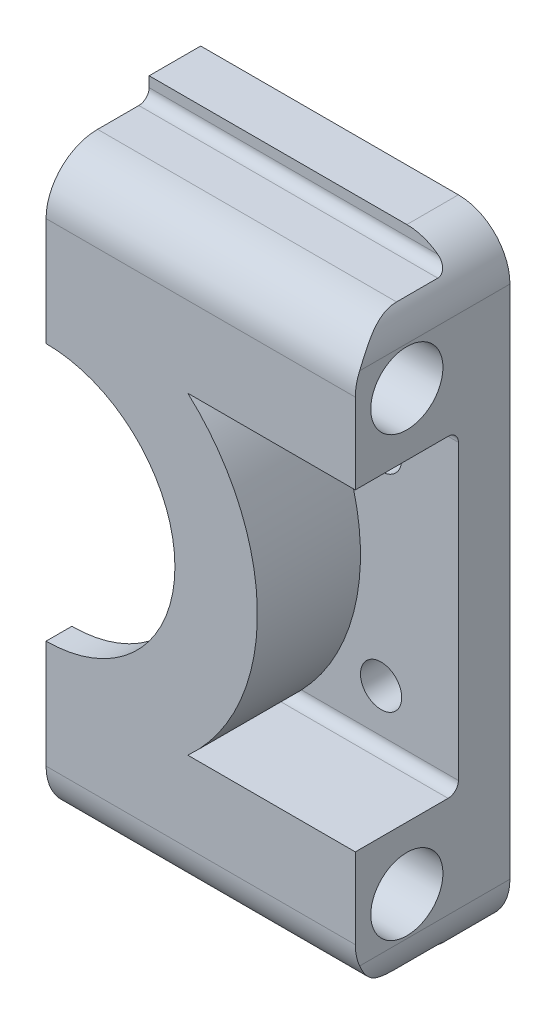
ISO-10303-21;
HEADER;
FILE_DESCRIPTION(('STEP AP214'),'2;1');
FILE_NAME('part.step','',(''),(''),'','','');
FILE_SCHEMA(('AUTOMOTIVE_DESIGN { 1 0 10303 214 1 1 1 1 }'));
ENDSEC;
DATA;
#1=APPLICATION_CONTEXT('core data for automotive mechanical design processes');
#2=APPLICATION_PROTOCOL_DEFINITION('international standard','automotive_design',2000,#1);
#3=PRODUCT_CONTEXT('',#1,'mechanical');
#4=PRODUCT('Part','Part','',(#3));
#5=PRODUCT_RELATED_PRODUCT_CATEGORY('part','',(#4));
#6=PRODUCT_DEFINITION_FORMATION('','',#4);
#7=PRODUCT_DEFINITION_CONTEXT('part definition',#1,'design');
#8=PRODUCT_DEFINITION('design','',#6,#7);
#9=PRODUCT_DEFINITION_SHAPE('','',#8);
#10=(LENGTH_UNIT() NAMED_UNIT(*) SI_UNIT(.MILLI.,.METRE.));
#11=(NAMED_UNIT(*) PLANE_ANGLE_UNIT() SI_UNIT($,.RADIAN.));
#12=(NAMED_UNIT(*) SI_UNIT($,.STERADIAN.) SOLID_ANGLE_UNIT());
#13=UNCERTAINTY_MEASURE_WITH_UNIT(LENGTH_MEASURE(1.E-05),#10,'distance_accuracy_value','');
#14=(GEOMETRIC_REPRESENTATION_CONTEXT(3) GLOBAL_UNCERTAINTY_ASSIGNED_CONTEXT((#13)) GLOBAL_UNIT_ASSIGNED_CONTEXT((#10,
#11,#12)) REPRESENTATION_CONTEXT('',''));
#15=CARTESIAN_POINT('',(0.,0.,0.));
#16=DIRECTION('',(0.,0.,1.));
#17=DIRECTION('',(1.,0.,0.));
#18=AXIS2_PLACEMENT_3D('',#15,#16,#17);
#19=CARTESIAN_POINT('',(9.02091893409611E-13,374.713939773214,-344.));
#20=DIRECTION('',(0.,0.,-1.));
#21=DIRECTION('',(-1.,0.,0.));
#22=AXIS2_PLACEMENT_3D('',#19,#20,#21);
#23=CYLINDRICAL_SURFACE('',#22,36.);
#24=DIRECTION('',(0.,0.,-1.));
#25=VECTOR('',#24,1.);
#26=CARTESIAN_POINT('',(0.,338.713939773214,-344.));
#27=LINE('',#26,#25);
#28=CARTESIAN_POINT('',(0.,338.713939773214,-354.));
#29=VERTEX_POINT('',#28);
#30=CARTESIAN_POINT('',(0.,338.713939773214,-336.598076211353));
#31=VERTEX_POINT('',#30);
#32=EDGE_CURVE('E239',#29,#31,#27,.F.);
#33=ORIENTED_EDGE('',*,*,#32,.T.);
#34=CARTESIAN_POINT('',(0.,338.713939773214,-336.598076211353));
#35=CARTESIAN_POINT('',(0.143758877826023,338.713939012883,-336.598067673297));
#36=CARTESIAN_POINT('',(0.287510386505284,338.714800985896,-336.595922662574));
#37=CARTESIAN_POINT('',(0.574875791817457,338.718243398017,-336.587289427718));
#38=CARTESIAN_POINT('',(0.718489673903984,338.720824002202,-336.58080078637));
#39=CARTESIAN_POINT('',(1.14987870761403,338.731156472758,-336.55465522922));
#40=CARTESIAN_POINT('',(1.43721767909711,338.741498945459,-336.528317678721));
#41=CARTESIAN_POINT('',(2.02442007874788,338.769642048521,-336.454480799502));
#42=CARTESIAN_POINT('',(2.32413949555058,338.787809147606,-336.405933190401));
#43=CARTESIAN_POINT('',(2.76926007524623,338.820300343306,-336.314519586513));
#44=CARTESIAN_POINT('',(2.91679526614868,338.831994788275,-336.280977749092));
#45=CARTESIAN_POINT('',(3.20997254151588,338.857033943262,-336.206997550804));
#46=CARTESIAN_POINT('',(3.3556150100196,338.870378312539,-336.166560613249));
#47=CARTESIAN_POINT('',(3.65314775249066,338.899442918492,-336.075207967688));
#48=CARTESIAN_POINT('',(3.80488076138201,338.91525819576,-336.023805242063));
#49=CARTESIAN_POINT('',(4.10450472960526,338.948373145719,-335.91073078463));
#50=CARTESIAN_POINT('',(4.25239243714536,338.965674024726,-335.849050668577));
#51=CARTESIAN_POINT('',(4.5406444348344,339.001149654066,-335.714233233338));
#52=CARTESIAN_POINT('',(4.6810773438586,339.019311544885,-335.641241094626));
#53=CARTESIAN_POINT('',(4.95314168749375,339.056050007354,-335.480654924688));
#54=CARTESIAN_POINT('',(5.08479116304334,339.074625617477,-335.393092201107));
#55=CARTESIAN_POINT('',(5.30543265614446,339.106892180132,-335.221856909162));
#56=CARTESIAN_POINT('',(5.39727100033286,339.120723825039,-335.141922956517));
#57=CARTESIAN_POINT('',(5.56822830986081,339.147069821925,-334.969185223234));
#58=CARTESIAN_POINT('',(5.64737952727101,339.159587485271,-334.876415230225));
#59=CARTESIAN_POINT('',(5.76093191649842,339.177849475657,-334.712783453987));
#60=CARTESIAN_POINT('',(5.80117346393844,339.18440778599,-334.646100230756));
#61=CARTESIAN_POINT('',(5.87105636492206,339.195888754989,-334.507182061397));
#62=CARTESIAN_POINT('',(5.90070425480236,339.200812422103,-334.434950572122));
#63=CARTESIAN_POINT('',(5.94695522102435,339.208527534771,-334.28530287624));
#64=CARTESIAN_POINT('',(5.96340729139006,339.211294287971,-334.207837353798));
#65=CARTESIAN_POINT('',(5.9806198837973,339.214189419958,-334.051156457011));
#66=CARTESIAN_POINT('',(5.98139903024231,339.214320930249,-333.971943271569));
#67=CARTESIAN_POINT('',(5.96827319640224,339.212112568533,-333.826537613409));
#68=CARTESIAN_POINT('',(5.95649717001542,339.21013099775,-333.760133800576));
#69=CARTESIAN_POINT('',(5.92261470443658,339.204463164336,-333.630100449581));
#70=CARTESIAN_POINT('',(5.90050057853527,339.20077563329,-333.5664730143));
#71=CARTESIAN_POINT('',(5.83740078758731,339.190340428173,-333.419329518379));
#72=CARTESIAN_POINT('',(5.792427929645,339.182961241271,-333.33757991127));
#73=CARTESIAN_POINT('',(5.69028893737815,339.166460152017,-333.182327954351));
#74=CARTESIAN_POINT('',(5.63309544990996,339.157334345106,-333.108844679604));
#75=CARTESIAN_POINT('',(5.46985798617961,339.131765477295,-332.924244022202));
#76=CARTESIAN_POINT('',(5.35632593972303,339.114439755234,-332.819938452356));
#77=CARTESIAN_POINT('',(5.11555609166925,339.079040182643,-332.628935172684));
#78=CARTESIAN_POINT('',(4.988282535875,339.060964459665,-332.542285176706));
#79=CARTESIAN_POINT('',(4.72523061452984,339.025148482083,-332.38319689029));
#80=CARTESIAN_POINT('',(4.58945243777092,339.007408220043,-332.310758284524));
#81=CARTESIAN_POINT('',(4.31215770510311,338.972858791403,-332.177433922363));
#82=CARTESIAN_POINT('',(4.17063558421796,338.956050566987,-332.116559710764));
#83=CARTESIAN_POINT('',(3.88299199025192,338.92366978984,-332.004267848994));
#84=CARTESIAN_POINT('',(3.73685155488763,338.908103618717,-331.952897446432));
#85=CARTESIAN_POINT('',(3.44180625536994,338.878538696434,-331.858611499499));
#86=CARTESIAN_POINT('',(3.29290238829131,338.864539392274,-331.815692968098));
#87=CARTESIAN_POINT('',(2.88474484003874,338.828771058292,-331.708897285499));
#88=CARTESIAN_POINT('',(2.62343850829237,338.808689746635,-331.652260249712));
#89=CARTESIAN_POINT('',(2.09701837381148,338.774097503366,-331.557290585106));
#90=CARTESIAN_POINT('',(1.83190121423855,338.759591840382,-331.518975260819));
#91=CARTESIAN_POINT('',(1.30578831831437,338.736688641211,-331.459381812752));
#92=CARTESIAN_POINT('',(1.04484104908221,338.728156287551,-331.437726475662));
#93=CARTESIAN_POINT('',(0.65303375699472,338.719626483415,-331.416187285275));
#94=CARTESIAN_POINT('',(0.522491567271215,338.71749467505,-331.41083143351));
#95=CARTESIAN_POINT('',(0.261302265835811,338.714651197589,-331.403702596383));
#96=CARTESIAN_POINT('',(0.130655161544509,338.713939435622,-331.401929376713));
#97=CARTESIAN_POINT('',(0.,338.713939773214,-331.401923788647));
#98=B_SPLINE_CURVE_WITH_KNOTS('',3,(#34,#35,#36,#37,#38,#39,#40,#41,#42,#43,#44,#45,#46,#47,#48,
#49,#50,#51,#52,#53,#54,#55,#56,#57,#58,#59,#60,#61,#62,#63,#64,#65,#66,#67,#68,#69,#70,#71,#72,
#73,#74,#75,#76,#77,#78,#79,#80,#81,#82,#83,#84,#85,#86,#87,#88,#89,#90,#91,#92,#93,#94,#95,#96,
#97),.UNSPECIFIED.,.F.,.F.,(4,2,2,2,2,2,2,2,2,2,2,2,2,2,2,2,2,2,2,2,2,2,2,2,2,2,2,2,2,2,2,4),
(0.,0.431242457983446,0.862526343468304,1.72803896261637,2.63945618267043,3.09456857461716,
3.54958713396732,4.03222088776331,4.51525031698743,4.99252776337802,5.46879262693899,
5.83549977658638,6.20125940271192,6.4349997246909,6.66859557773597,6.90482789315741,
7.14077947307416,7.34225470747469,7.54387998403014,7.8230782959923,8.1029082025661,
8.5657207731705,9.02976796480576,9.49380485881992,9.9583025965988,10.4250509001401,
10.891633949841,11.6950842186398,12.4992918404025,13.2847061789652,13.6766666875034,
14.0686015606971),.UNSPECIFIED.);
#99=CARTESIAN_POINT('',(0.,338.713939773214,-331.401923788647));
#100=VERTEX_POINT('',#99);
#101=EDGE_CURVE('E226',#31,#100,#98,.T.);
#102=ORIENTED_EDGE('',*,*,#101,.T.);
#103=CARTESIAN_POINT('',(0.,338.713939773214,-329.));
#104=VERTEX_POINT('',#103);
#105=EDGE_CURVE('E236',#100,#104,#27,.F.);
#106=ORIENTED_EDGE('',*,*,#105,.T.);
#107=CARTESIAN_POINT('',(9.02091893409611E-13,374.713939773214,-329.));
#108=DIRECTION('',(0.,0.,1.));
#109=DIRECTION('',(1.,0.,0.));
#110=AXIS2_PLACEMENT_3D('',#107,#108,#109);
#111=CIRCLE('',#110,36.);
#112=CARTESIAN_POINT('',(0.,410.713939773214,-329.));
#113=VERTEX_POINT('',#112);
#114=EDGE_CURVE('E291',#104,#113,#111,.T.);
#115=ORIENTED_EDGE('',*,*,#114,.T.);
#116=DIRECTION('',(0.,0.,-1.));
#117=VECTOR('',#116,1.);
#118=CARTESIAN_POINT('',(0.,410.713939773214,-344.));
#119=LINE('',#118,#117);
#120=CARTESIAN_POINT('',(0.,410.713939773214,-331.401923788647));
#121=VERTEX_POINT('',#120);
#122=EDGE_CURVE('E272',#113,#121,#119,.T.);
#123=ORIENTED_EDGE('',*,*,#122,.T.);
#124=CARTESIAN_POINT('',(0.,410.713939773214,-336.598076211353));
#125=CARTESIAN_POINT('',(0.143758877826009,410.713940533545,-336.598067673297));
#126=CARTESIAN_POINT('',(0.287510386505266,410.713078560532,-336.595922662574));
#127=CARTESIAN_POINT('',(0.574875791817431,410.709636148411,-336.587289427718));
#128=CARTESIAN_POINT('',(0.718489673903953,410.707055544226,-336.58080078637));
#129=CARTESIAN_POINT('',(1.14987870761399,410.696723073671,-336.55465522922));
#130=CARTESIAN_POINT('',(1.43721767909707,410.686380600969,-336.528317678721));
#131=CARTESIAN_POINT('',(2.02442007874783,410.658237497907,-336.454480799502));
#132=CARTESIAN_POINT('',(2.32413949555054,410.640070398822,-336.405933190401));
#133=CARTESIAN_POINT('',(2.76926007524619,410.607579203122,-336.314519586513));
#134=CARTESIAN_POINT('',(2.91679526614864,410.595884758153,-336.280977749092));
#135=CARTESIAN_POINT('',(3.20997254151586,410.570845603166,-336.206997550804));
#136=CARTESIAN_POINT('',(3.35561501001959,410.557501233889,-336.166560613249));
#137=CARTESIAN_POINT('',(3.65314775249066,410.528436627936,-336.075207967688));
#138=CARTESIAN_POINT('',(3.804880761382,410.512621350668,-336.023805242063));
#139=CARTESIAN_POINT('',(4.10450472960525,410.479506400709,-335.91073078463));
#140=CARTESIAN_POINT('',(4.25239243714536,410.462205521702,-335.849050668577));
#141=CARTESIAN_POINT('',(4.5406444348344,410.426729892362,-335.714233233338));
#142=CARTESIAN_POINT('',(4.6810773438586,410.408568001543,-335.641241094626));
#143=CARTESIAN_POINT('',(4.95314168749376,410.371829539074,-335.480654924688));
#144=CARTESIAN_POINT('',(5.08479116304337,410.353253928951,-335.393092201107));
#145=CARTESIAN_POINT('',(5.3054326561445,410.320987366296,-335.221856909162));
#146=CARTESIAN_POINT('',(5.3972710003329,410.307155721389,-335.141922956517));
#147=CARTESIAN_POINT('',(5.5682283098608,410.280809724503,-334.969185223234));
#148=CARTESIAN_POINT('',(5.64737952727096,410.268292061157,-334.876415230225));
#149=CARTESIAN_POINT('',(5.76093191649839,410.250030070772,-334.712783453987));
#150=CARTESIAN_POINT('',(5.80117346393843,410.243471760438,-334.646100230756));
#151=CARTESIAN_POINT('',(5.87105636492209,410.231990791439,-334.507182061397));
#152=CARTESIAN_POINT('',(5.90070425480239,410.227067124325,-334.434950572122));
#153=CARTESIAN_POINT('',(5.94695522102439,410.219352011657,-334.28530287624));
#154=CARTESIAN_POINT('',(5.96340729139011,410.216585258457,-334.207837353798));
#155=CARTESIAN_POINT('',(5.98061988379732,410.21369012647,-334.05115645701));
#156=CARTESIAN_POINT('',(5.9813990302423,410.213558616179,-333.971943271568));
#157=CARTESIAN_POINT('',(5.9682731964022,410.215766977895,-333.826537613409));
#158=CARTESIAN_POINT('',(5.95649717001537,410.217748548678,-333.760133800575));
#159=CARTESIAN_POINT('',(5.92261470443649,410.223416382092,-333.630100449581));
#160=CARTESIAN_POINT('',(5.90050057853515,410.227103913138,-333.566473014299));
#161=CARTESIAN_POINT('',(5.83740078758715,410.237539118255,-333.419329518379));
#162=CARTESIAN_POINT('',(5.79242792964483,410.244918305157,-333.33757991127));
#163=CARTESIAN_POINT('',(5.69028893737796,410.261419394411,-333.182327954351));
#164=CARTESIAN_POINT('',(5.63309544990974,410.270545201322,-333.108844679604));
#165=CARTESIAN_POINT('',(5.46985798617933,410.296114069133,-332.924244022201));
#166=CARTESIAN_POINT('',(5.3563259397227,410.313439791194,-332.819938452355));
#167=CARTESIAN_POINT('',(5.11555609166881,410.348839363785,-332.628935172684));
#168=CARTESIAN_POINT('',(4.98828253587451,410.366915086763,-332.542285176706));
#169=CARTESIAN_POINT('',(4.72523061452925,410.402731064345,-332.38319689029));
#170=CARTESIAN_POINT('',(4.58945243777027,410.420471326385,-332.310758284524));
#171=CARTESIAN_POINT('',(4.31215770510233,410.455020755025,-332.177433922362));
#172=CARTESIAN_POINT('',(4.17063558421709,410.471828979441,-332.116559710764));
#173=CARTESIAN_POINT('',(3.88299199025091,410.504209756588,-332.004267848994));
#174=CARTESIAN_POINT('',(3.73685155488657,410.519775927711,-331.952897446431));
#175=CARTESIAN_POINT('',(3.44180625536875,410.549340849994,-331.858611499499));
#176=CARTESIAN_POINT('',(3.29290238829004,410.563340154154,-331.815692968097));
#177=CARTESIAN_POINT('',(2.88474484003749,410.599108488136,-331.708897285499));
#178=CARTESIAN_POINT('',(2.62343850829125,410.619189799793,-331.652260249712));
#179=CARTESIAN_POINT('',(2.0970183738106,410.653782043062,-331.557290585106));
#180=CARTESIAN_POINT('',(1.83190121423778,410.668287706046,-331.518975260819));
#181=CARTESIAN_POINT('',(1.30578831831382,410.691190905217,-331.459381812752));
#182=CARTESIAN_POINT('',(1.04484104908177,410.699723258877,-331.437726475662));
#183=CARTESIAN_POINT('',(0.653033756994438,410.708253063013,-331.416187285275));
#184=CARTESIAN_POINT('',(0.522491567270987,410.710384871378,-331.41083143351));
#185=CARTESIAN_POINT('',(0.261302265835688,410.713228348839,-331.403702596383));
#186=CARTESIAN_POINT('',(0.130655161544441,410.713940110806,-331.401929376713));
#187=CARTESIAN_POINT('',(0.,410.713939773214,-331.401923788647));
#188=B_SPLINE_CURVE_WITH_KNOTS('',3,(#124,#125,#126,#127,#128,#129,#130,#131,#132,#133,#134,
#135,#136,#137,#138,#139,#140,#141,#142,#143,#144,#145,#146,#147,#148,#149,#150,#151,#152,#153,
#154,#155,#156,#157,#158,#159,#160,#161,#162,#163,#164,#165,#166,#167,#168,#169,#170,#171,#172,
#173,#174,#175,#176,#177,#178,#179,#180,#181,#182,#183,#184,#185,#186,#187),.UNSPECIFIED.,.F.,
.F.,(4,2,2,2,2,2,2,2,2,2,2,2,2,2,2,2,2,2,2,2,2,2,2,2,2,2,2,2,2,2,2,4),(0.,0.431242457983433,
0.862526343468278,1.72803896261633,2.63945618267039,3.09456857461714,3.54958713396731,
4.03222088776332,4.51525031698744,4.99252776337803,5.46879262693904,5.83549977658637,
6.20125940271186,6.43499972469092,6.66859557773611,6.90482789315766,7.1407794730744,
7.34225470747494,7.54387998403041,7.8230782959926,8.10290820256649,8.56572077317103,
9.02976796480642,9.49380485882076,9.9583025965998,10.4250509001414,10.8916339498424,
11.6950842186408,12.4992918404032,13.2847061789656,13.6766666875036,14.0686015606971),.UNSPECIFIED.);
#189=CARTESIAN_POINT('',(0.,410.713939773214,-336.598076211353));
#190=VERTEX_POINT('',#189);
#191=EDGE_CURVE('E557',#190,#121,#188,.T.);
#192=ORIENTED_EDGE('',*,*,#191,.F.);
#193=CARTESIAN_POINT('',(0.,410.713939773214,-354.));
#194=VERTEX_POINT('',#193);
#195=EDGE_CURVE('E276',#190,#194,#119,.T.);
#196=ORIENTED_EDGE('',*,*,#195,.T.);
#197=CARTESIAN_POINT('',(9.02091893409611E-13,374.713939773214,-354.));
#198=DIRECTION('',(0.,0.,1.));
#199=DIRECTION('',(1.,0.,0.));
#200=AXIS2_PLACEMENT_3D('',#197,#198,#199);
#201=CIRCLE('',#200,36.);
#202=EDGE_CURVE('E307',#29,#194,#201,.T.);
#203=ORIENTED_EDGE('',*,*,#202,.F.);
#204=EDGE_LOOP('',(#33,#102,#106,#115,#123,#192,#196,#203));
#205=FACE_BOUND('',#204,.T.);
#206=ADVANCED_FACE('F45',(#205),#23,.F.);
#207=CARTESIAN_POINT('',(50.0000000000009,424.713939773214,-344.));
#208=DIRECTION('',(0.,0.,-1.));
#209=DIRECTION('',(-1.,0.,0.));
#210=AXIS2_PLACEMENT_3D('',#207,#208,#209);
#211=PLANE('',#210);
#212=CARTESIAN_POINT('',(50.0000000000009,324.713939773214,-344.));
#213=DIRECTION('',(0.,0.,1.));
#214=DIRECTION('',(1.,0.,0.));
#215=AXIS2_PLACEMENT_3D('',#212,#213,#214);
#216=CIRCLE('',#215,10.);
#217=CARTESIAN_POINT('',(50.0000000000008,314.713939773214,-344.));
#218=VERTEX_POINT('',#217);
#219=CARTESIAN_POINT('',(56.0000000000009,316.713939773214,-344.));
#220=VERTEX_POINT('',#219);
#221=EDGE_CURVE('E326',#218,#220,#216,.T.);
#222=ORIENTED_EDGE('',*,*,#221,.T.);
#223=DIRECTION('',(-1.,0.,0.));
#224=VECTOR('',#223,1.);
#225=CARTESIAN_POINT('',(50.0000000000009,316.713939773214,-344.));
#226=LINE('',#225,#224);
#227=CARTESIAN_POINT('',(0.,316.713939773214,-344.));
#228=VERTEX_POINT('',#227);
#229=EDGE_CURVE('E423',#220,#228,#226,.T.);
#230=ORIENTED_EDGE('',*,*,#229,.T.);
#231=DIRECTION('',(0.,1.,0.));
#232=VECTOR('',#231,1.);
#233=CARTESIAN_POINT('',(0.,424.713939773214,-344.));
#234=LINE('',#233,#232);
#235=CARTESIAN_POINT('',(0.,314.713939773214,-344.));
#236=VERTEX_POINT('',#235);
#237=EDGE_CURVE('E262',#236,#228,#234,.T.);
#238=ORIENTED_EDGE('',*,*,#237,.F.);
#239=DIRECTION('',(1.,0.,0.));
#240=VECTOR('',#239,1.);
#241=CARTESIAN_POINT('',(50.0000000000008,314.713939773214,-344.));
#242=LINE('',#241,#240);
#243=EDGE_CURVE('E323',#236,#218,#242,.T.);
#244=ORIENTED_EDGE('',*,*,#243,.T.);
#245=EDGE_LOOP('',(#222,#230,#238,#244));
#246=FACE_BOUND('',#245,.T.);
#247=ADVANCED_FACE('F598',(#246),#211,.F.);
#248=CARTESIAN_POINT('',(45.,354.713939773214,-344.));
#249=DIRECTION('',(0.,0.,1.));
#250=DIRECTION('',(1.,0.,0.));
#251=AXIS2_PLACEMENT_3D('',#248,#249,#250);
#252=CIRCLE('',#251,4.00000000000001);
#253=CARTESIAN_POINT('',(49.,354.713939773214,-344.));
#254=VERTEX_POINT('',#253);
#255=EDGE_CURVE('E295',#254,#254,#252,.T.);
#256=ORIENTED_EDGE('',*,*,#255,.F.);
#257=EDGE_LOOP('',(#256));
#258=FACE_BOUND('',#257,.T.);
#259=CARTESIAN_POINT('',(45.,394.713939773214,-344.));
#260=DIRECTION('',(0.,0.,1.));
#261=DIRECTION('',(1.,0.,0.));
#262=AXIS2_PLACEMENT_3D('',#259,#260,#261);
#263=CIRCLE('',#262,4.00000000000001);
#264=CARTESIAN_POINT('',(49.,394.713939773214,-344.));
#265=VERTEX_POINT('',#264);
#266=EDGE_CURVE('E303',#265,#265,#263,.T.);
#267=ORIENTED_EDGE('',*,*,#266,.F.);
#268=EDGE_LOOP('',(#267));
#269=FACE_BOUND('',#268,.T.);
#270=CARTESIAN_POINT('',(9.02091893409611E-13,374.713939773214,-344.));
#271=DIRECTION('',(0.,0.,-1.));
#272=DIRECTION('',(-1.,0.,0.));
#273=AXIS2_PLACEMENT_3D('',#270,#271,#272);
#274=CIRCLE('',#273,41.);
#275=CARTESIAN_POINT('',(29.5616104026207,346.304237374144,-344.));
#276=VERTEX_POINT('',#275);
#277=CARTESIAN_POINT('',(29.5616104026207,403.123642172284,-344.));
#278=VERTEX_POINT('',#277);
#279=EDGE_CURVE('E364',#276,#278,#274,.F.);
#280=ORIENTED_EDGE('',*,*,#279,.F.);
#281=DIRECTION('',(1.,0.,0.));
#282=VECTOR('',#281,1.);
#283=CARTESIAN_POINT('',(50.0000000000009,346.304237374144,-344.));
#284=LINE('',#283,#282);
#285=CARTESIAN_POINT('',(60.0000000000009,346.304237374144,-344.));
#286=VERTEX_POINT('',#285);
#287=EDGE_CURVE('E231',#276,#286,#284,.T.);
#288=ORIENTED_EDGE('',*,*,#287,.T.);
#289=DIRECTION('',(0.,1.,0.));
#290=VECTOR('',#289,1.);
#291=CARTESIAN_POINT('',(60.0000000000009,424.713939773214,-344.));
#292=LINE('',#291,#290);
#293=CARTESIAN_POINT('',(60.0000000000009,403.123642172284,-344.));
#294=VERTEX_POINT('',#293);
#295=EDGE_CURVE('E330',#286,#294,#292,.T.);
#296=ORIENTED_EDGE('',*,*,#295,.T.);
#297=DIRECTION('',(1.,0.,0.));
#298=VECTOR('',#297,1.);
#299=CARTESIAN_POINT('',(27.5000000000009,403.123642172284,-344.));
#300=LINE('',#299,#298);
#301=EDGE_CURVE('E382',#294,#278,#300,.F.);
#302=ORIENTED_EDGE('',*,*,#301,.T.);
#303=EDGE_LOOP('',(#280,#288,#296,#302));
#304=FACE_BOUND('',#303,.T.);
#305=ADVANCED_FACE('F604',(#258,#269,#304),#211,.F.);
#306=CARTESIAN_POINT('',(0.,432.713939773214,-344.));
#307=VERTEX_POINT('',#306);
#308=CARTESIAN_POINT('',(0.,434.713939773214,-344.));
#309=VERTEX_POINT('',#308);
#310=EDGE_CURVE('E268',#307,#309,#234,.T.);
#311=ORIENTED_EDGE('',*,*,#310,.F.);
#312=DIRECTION('',(-1.,0.,0.));
#313=VECTOR('',#312,1.);
#314=CARTESIAN_POINT('',(58.0000000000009,432.713939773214,-344.));
#315=LINE('',#314,#313);
#316=CARTESIAN_POINT('',(56.0000000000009,432.713939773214,-344.));
#317=VERTEX_POINT('',#316);
#318=EDGE_CURVE('E515',#307,#317,#315,.F.);
#319=ORIENTED_EDGE('',*,*,#318,.T.);
#320=CARTESIAN_POINT('',(50.0000000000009,424.713939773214,-344.));
#321=DIRECTION('',(0.,0.,1.));
#322=DIRECTION('',(-1.,0.,0.));
#323=AXIS2_PLACEMENT_3D('',#320,#321,#322);
#324=CIRCLE('',#323,10.);
#325=CARTESIAN_POINT('',(50.0000000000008,434.713939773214,-344.));
#326=VERTEX_POINT('',#325);
#327=EDGE_CURVE('E315',#317,#326,#324,.T.);
#328=ORIENTED_EDGE('',*,*,#327,.T.);
#329=DIRECTION('',(-1.,0.,0.));
#330=VECTOR('',#329,1.);
#331=CARTESIAN_POINT('',(50.0000000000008,434.713939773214,-344.));
#332=LINE('',#331,#330);
#333=EDGE_CURVE('E318',#326,#309,#332,.T.);
#334=ORIENTED_EDGE('',*,*,#333,.T.);
#335=EDGE_LOOP('',(#311,#319,#328,#334));
#336=FACE_BOUND('',#335,.T.);
#337=ADVANCED_FACE('F406',(#336),#211,.F.);
#338=CARTESIAN_POINT('',(9.02091893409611E-13,374.713939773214,-329.));
#339=DIRECTION('',(0.,0.,-1.));
#340=DIRECTION('',(-1.,0.,0.));
#341=AXIS2_PLACEMENT_3D('',#338,#339,#340);
#342=CYLINDRICAL_SURFACE('',#341,41.);
#343=DIRECTION('',(0.,0.,-1.));
#344=VECTOR('',#343,1.);
#345=CARTESIAN_POINT('',(27.5000000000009,344.304237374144,-324.));
#346=LINE('',#345,#344);
#347=CARTESIAN_POINT('',(27.5000000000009,344.304237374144,-324.));
#348=VERTEX_POINT('',#347);
#349=CARTESIAN_POINT('',(27.5000000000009,344.304237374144,-342.));
#350=VERTEX_POINT('',#349);
#351=EDGE_CURVE('E653',#348,#350,#346,.T.);
#352=ORIENTED_EDGE('',*,*,#351,.T.);
#353=CARTESIAN_POINT('',(27.5000000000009,344.304237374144,-342.));
#354=CARTESIAN_POINT('',(27.4999857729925,344.304225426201,-342.043837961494));
#355=CARTESIAN_POINT('',(27.5015933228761,344.305678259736,-342.087665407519));
#356=CARTESIAN_POINT('',(27.5079421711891,344.311420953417,-342.174863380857));
#357=CARTESIAN_POINT('',(27.5126803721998,344.315708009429,-342.21823431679));
#358=CARTESIAN_POINT('',(27.5251193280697,344.326971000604,-342.30374679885));
#359=CARTESIAN_POINT('',(27.5327903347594,344.333919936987,-342.345896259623));
#360=CARTESIAN_POINT('',(27.5509058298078,344.350347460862,-342.429085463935));
#361=CARTESIAN_POINT('',(27.5613508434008,344.359826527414,-342.470124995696));
#362=CARTESIAN_POINT('',(27.5964318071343,344.391704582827,-342.590856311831));
#363=CARTESIAN_POINT('',(27.6248755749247,344.417600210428,-342.668564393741));
#364=CARTESIAN_POINT('',(27.6900068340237,344.477116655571,-342.817370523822));
#365=CARTESIAN_POINT('',(27.7267164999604,344.510758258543,-342.8884500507));
#366=CARTESIAN_POINT('',(27.8254560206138,344.601644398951,-343.055464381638));
#367=CARTESIAN_POINT('',(27.8912392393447,344.662517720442,-343.147207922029));
#368=CARTESIAN_POINT('',(28.0320856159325,344.793854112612,-343.315361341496));
#369=CARTESIAN_POINT('',(28.1071677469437,344.864336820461,-343.391739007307));
#370=CARTESIAN_POINT('',(28.2960903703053,345.043173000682,-343.558952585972));
#371=CARTESIAN_POINT('',(28.413025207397,345.155051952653,-343.642511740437));
#372=CARTESIAN_POINT('',(28.6534592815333,345.388055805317,-343.783018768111));
#373=CARTESIAN_POINT('',(28.7769691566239,345.509195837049,-343.839921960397));
#374=CARTESIAN_POINT('',(29.0112322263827,345.742019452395,-343.92280656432));
#375=CARTESIAN_POINT('',(29.1216494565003,345.852991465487,-343.951764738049));
#376=CARTESIAN_POINT('',(29.2871526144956,346.021277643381,-343.980693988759));
#377=CARTESIAN_POINT('',(29.3421474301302,346.077519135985,-343.987918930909));
#378=CARTESIAN_POINT('',(29.4520151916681,346.1905279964,-343.997568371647));
#379=CARTESIAN_POINT('',(29.5068881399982,346.247295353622,-343.999992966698));
#380=CARTESIAN_POINT('',(29.5616104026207,346.304237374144,-344.));
#381=B_SPLINE_CURVE_WITH_KNOTS('',3,(#353,#354,#355,#356,#357,#358,#359,#360,#361,#362,#363,
#364,#365,#366,#367,#368,#369,#370,#371,#372,#373,#374,#375,#376,#377,#378,#379,#380),
.UNSPECIFIED.,.F.,.F.,(4,2,2,2,2,2,2,2,2,2,2,2,2,4),(0.,0.13144334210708,0.262756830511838,
0.39277227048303,0.522812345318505,0.781673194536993,1.04123693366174,1.42385098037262,
1.8072589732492,2.35073958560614,2.89512795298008,3.37144651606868,3.60829477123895,
3.84513826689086),.UNSPECIFIED.);
#382=EDGE_CURVE('E414',#350,#276,#381,.T.);
#383=ORIENTED_EDGE('',*,*,#382,.T.);
#384=ORIENTED_EDGE('',*,*,#279,.T.);
#385=CARTESIAN_POINT('',(29.5616104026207,403.123642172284,-344.));
#386=CARTESIAN_POINT('',(29.4871420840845,403.20113569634,-343.999978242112));
#387=CARTESIAN_POINT('',(29.4123666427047,403.278327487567,-343.995495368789));
#388=CARTESIAN_POINT('',(29.2626690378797,403.431662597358,-343.977652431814));
#389=CARTESIAN_POINT('',(29.1877468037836,403.507804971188,-343.964284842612));
#390=CARTESIAN_POINT('',(29.0376787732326,403.659141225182,-343.928557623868));
#391=CARTESIAN_POINT('',(28.9625370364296,403.734320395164,-343.906118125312));
#392=CARTESIAN_POINT('',(28.8133794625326,403.882419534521,-343.852151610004));
#393=CARTESIAN_POINT('',(28.7393631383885,403.955340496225,-343.820628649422));
#394=CARTESIAN_POINT('',(28.5572737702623,404.133410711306,-343.730505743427));
#395=CARTESIAN_POINT('',(28.4502741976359,404.23685375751,-343.66620574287));
#396=CARTESIAN_POINT('',(28.2438015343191,404.434437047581,-343.515647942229));
#397=CARTESIAN_POINT('',(28.1443048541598,404.528606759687,-343.429463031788));
#398=CARTESIAN_POINT('',(27.9861127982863,404.677008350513,-343.263097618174));
#399=CARTESIAN_POINT('',(27.9242078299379,404.734679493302,-343.189054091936));
#400=CARTESIAN_POINT('',(27.809044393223,404.841388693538,-343.028872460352));
#401=CARTESIAN_POINT('',(27.7557763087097,404.890436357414,-342.942748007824));
#402=CARTESIAN_POINT('',(27.6717996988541,404.967435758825,-342.778923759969));
#403=CARTESIAN_POINT('',(27.6387058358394,404.997654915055,-342.703524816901));
#404=CARTESIAN_POINT('',(27.5820215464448,405.049291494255,-342.546502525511));
#405=CARTESIAN_POINT('',(27.5584067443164,405.070731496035,-342.464895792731));
#406=CARTESIAN_POINT('',(27.5272499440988,405.098982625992,-342.319354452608));
#407=CARTESIAN_POINT('',(27.5171117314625,405.108160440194,-342.256433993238));
#408=CARTESIAN_POINT('',(27.506887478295,405.117412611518,-342.160967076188));
#409=CARTESIAN_POINT('',(27.5043097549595,405.119744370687,-342.128884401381));
#410=CARTESIAN_POINT('',(27.5008641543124,405.12286072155,-342.064537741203));
#411=CARTESIAN_POINT('',(27.4999970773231,405.123644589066,-342.032273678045));
#412=CARTESIAN_POINT('',(27.5000000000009,405.123642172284,-342.));
#413=B_SPLINE_CURVE_WITH_KNOTS('',3,(#385,#386,#387,#388,#389,#390,#391,#392,#393,#394,#395,
#396,#397,#398,#399,#400,#401,#402,#403,#404,#405,#406,#407,#408,#409,#410,#411,#412),
.UNSPECIFIED.,.F.,.F.,(4,2,2,2,2,2,2,2,2,2,2,2,2,4),(0.,0.322323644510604,0.644920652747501,
0.97042189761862,1.2957780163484,1.78047356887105,2.26357550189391,2.59984098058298,
2.93572945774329,3.19788393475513,3.45935988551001,3.65188933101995,3.74862557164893,
3.84540705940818),.UNSPECIFIED.);
#414=CARTESIAN_POINT('',(27.5000000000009,405.123642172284,-342.));
#415=VERTEX_POINT('',#414);
#416=EDGE_CURVE('E386',#278,#415,#413,.T.);
#417=ORIENTED_EDGE('',*,*,#416,.T.);
#418=DIRECTION('',(0.,0.,-1.));
#419=VECTOR('',#418,1.);
#420=CARTESIAN_POINT('',(27.5000000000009,405.123642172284,-324.));
#421=LINE('',#420,#419);
#422=CARTESIAN_POINT('',(27.5000000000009,405.123642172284,-324.));
#423=VERTEX_POINT('',#422);
#424=EDGE_CURVE('E531',#423,#415,#421,.T.);
#425=ORIENTED_EDGE('',*,*,#424,.F.);
#426=CARTESIAN_POINT('',(9.02091893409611E-13,374.713939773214,-324.));
#427=DIRECTION('',(0.,0.,1.));
#428=DIRECTION('',(1.,0.,0.));
#429=AXIS2_PLACEMENT_3D('',#426,#427,#428);
#430=CIRCLE('',#429,41.);
#431=EDGE_CURVE('E285',#348,#423,#430,.T.);
#432=ORIENTED_EDGE('',*,*,#431,.F.);
#433=EDGE_LOOP('',(#352,#383,#384,#417,#425,#432));
#434=FACE_BOUND('',#433,.T.);
#435=ADVANCED_FACE('F400',(#434),#342,.T.);
#436=CARTESIAN_POINT('',(50.0000000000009,424.713939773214,-354.));
#437=DIRECTION('',(0.,0.,-1.));
#438=DIRECTION('',(-1.,0.,0.));
#439=AXIS2_PLACEMENT_3D('',#436,#437,#438);
#440=PLANE('',#439);
#441=CARTESIAN_POINT('',(45.,394.713939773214,-354.));
#442=DIRECTION('',(0.,0.,1.));
#443=DIRECTION('',(1.,0.,0.));
#444=AXIS2_PLACEMENT_3D('',#441,#442,#443);
#445=CIRCLE('',#444,4.00000000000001);
#446=CARTESIAN_POINT('',(49.,394.713939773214,-354.));
#447=VERTEX_POINT('',#446);
#448=EDGE_CURVE('E299',#447,#447,#445,.T.);
#449=ORIENTED_EDGE('',*,*,#448,.T.);
#450=EDGE_LOOP('',(#449));
#451=FACE_BOUND('',#450,.T.);
#452=CARTESIAN_POINT('',(45.,354.713939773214,-354.));
#453=DIRECTION('',(0.,0.,1.));
#454=DIRECTION('',(1.,0.,0.));
#455=AXIS2_PLACEMENT_3D('',#452,#453,#454);
#456=CIRCLE('',#455,4.00000000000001);
#457=CARTESIAN_POINT('',(49.,354.713939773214,-354.));
#458=VERTEX_POINT('',#457);
#459=EDGE_CURVE('E294',#458,#458,#456,.T.);
#460=ORIENTED_EDGE('',*,*,#459,.T.);
#461=EDGE_LOOP('',(#460));
#462=FACE_BOUND('',#461,.T.);
#463=DIRECTION('',(1.,0.,0.));
#464=VECTOR('',#463,1.);
#465=CARTESIAN_POINT('',(50.0000000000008,314.713939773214,-354.));
#466=LINE('',#465,#464);
#467=CARTESIAN_POINT('',(0.,314.713939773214,-354.));
#468=VERTEX_POINT('',#467);
#469=CARTESIAN_POINT('',(50.0000000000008,314.713939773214,-354.));
#470=VERTEX_POINT('',#469);
#471=EDGE_CURVE('E341',#468,#470,#466,.T.);
#472=ORIENTED_EDGE('',*,*,#471,.F.);
#473=DIRECTION('',(0.,1.,0.));
#474=VECTOR('',#473,1.);
#475=CARTESIAN_POINT('',(0.,424.713939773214,-354.));
#476=LINE('',#475,#474);
#477=EDGE_CURVE('E253',#468,#29,#476,.T.);
#478=ORIENTED_EDGE('',*,*,#477,.T.);
#479=ORIENTED_EDGE('',*,*,#202,.T.);
#480=CARTESIAN_POINT('',(0.,434.713939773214,-354.));
#481=VERTEX_POINT('',#480);
#482=EDGE_CURVE('E263',#194,#481,#476,.T.);
#483=ORIENTED_EDGE('',*,*,#482,.T.);
#484=DIRECTION('',(-1.,0.,0.));
#485=VECTOR('',#484,1.);
#486=CARTESIAN_POINT('',(50.0000000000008,434.713939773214,-354.));
#487=LINE('',#486,#485);
#488=CARTESIAN_POINT('',(50.0000000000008,434.713939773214,-354.));
#489=VERTEX_POINT('',#488);
#490=EDGE_CURVE('E337',#489,#481,#487,.T.);
#491=ORIENTED_EDGE('',*,*,#490,.F.);
#492=CARTESIAN_POINT('',(50.0000000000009,424.713939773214,-354.));
#493=DIRECTION('',(0.,0.,1.));
#494=DIRECTION('',(-1.,0.,0.));
#495=AXIS2_PLACEMENT_3D('',#492,#493,#494);
#496=CIRCLE('',#495,10.);
#497=CARTESIAN_POINT('',(60.0000000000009,424.713939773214,-354.));
#498=VERTEX_POINT('',#497);
#499=EDGE_CURVE('E314',#498,#489,#496,.T.);
#500=ORIENTED_EDGE('',*,*,#499,.F.);
#501=DIRECTION('',(0.,1.,0.));
#502=VECTOR('',#501,1.);
#503=CARTESIAN_POINT('',(60.0000000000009,424.713939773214,-354.));
#504=LINE('',#503,#502);
#505=CARTESIAN_POINT('',(60.0000000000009,324.713939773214,-354.));
#506=VERTEX_POINT('',#505);
#507=EDGE_CURVE('E319',#506,#498,#504,.T.);
#508=ORIENTED_EDGE('',*,*,#507,.F.);
#509=CARTESIAN_POINT('',(50.0000000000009,324.713939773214,-354.));
#510=DIRECTION('',(0.,0.,1.));
#511=DIRECTION('',(1.,0.,0.));
#512=AXIS2_PLACEMENT_3D('',#509,#510,#511);
#513=CIRCLE('',#512,10.);
#514=EDGE_CURVE('E344',#470,#506,#513,.T.);
#515=ORIENTED_EDGE('',*,*,#514,.F.);
#516=EDGE_LOOP('',(#472,#478,#479,#483,#491,#500,#508,#515));
#517=FACE_BOUND('',#516,.T.);
#518=ADVANCED_FACE('F405',(#451,#462,#517),#440,.T.);
#519=CARTESIAN_POINT('',(50.0000000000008,434.713939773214,-344.));
#520=DIRECTION('',(0.,-1.,0.));
#521=DIRECTION('',(0.,0.,-1.));
#522=AXIS2_PLACEMENT_3D('',#519,#520,#521);
#523=PLANE('',#522);
#524=DIRECTION('',(0.,0.,-1.));
#525=VECTOR('',#524,1.);
#526=CARTESIAN_POINT('',(0.,434.713939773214,-344.));
#527=LINE('',#526,#525);
#528=EDGE_CURVE('E277',#309,#481,#527,.T.);
#529=ORIENTED_EDGE('',*,*,#528,.F.);
#530=ORIENTED_EDGE('',*,*,#333,.F.);
#531=DIRECTION('',(0.,0.,-1.));
#532=VECTOR('',#531,1.);
#533=CARTESIAN_POINT('',(50.0000000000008,434.713939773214,-344.));
#534=LINE('',#533,#532);
#535=EDGE_CURVE('E360',#326,#489,#534,.T.);
#536=ORIENTED_EDGE('',*,*,#535,.T.);
#537=ORIENTED_EDGE('',*,*,#490,.T.);
#538=EDGE_LOOP('',(#529,#530,#536,#537));
#539=FACE_BOUND('',#538,.T.);
#540=ADVANCED_FACE('F627',(#539),#523,.F.);
#541=CARTESIAN_POINT('',(50.0000000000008,314.713939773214,-344.));
#542=DIRECTION('',(0.,1.,0.));
#543=DIRECTION('',(0.,0.,1.));
#544=AXIS2_PLACEMENT_3D('',#541,#542,#543);
#545=PLANE('',#544);
#546=DIRECTION('',(0.,0.,1.));
#547=VECTOR('',#546,1.);
#548=CARTESIAN_POINT('',(0.,314.713939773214,-344.));
#549=LINE('',#548,#547);
#550=EDGE_CURVE('E267',#468,#236,#549,.T.);
#551=ORIENTED_EDGE('',*,*,#550,.F.);
#552=ORIENTED_EDGE('',*,*,#471,.T.);
#553=DIRECTION('',(0.,0.,-1.));
#554=VECTOR('',#553,1.);
#555=CARTESIAN_POINT('',(50.0000000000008,314.713939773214,-344.));
#556=LINE('',#555,#554);
#557=EDGE_CURVE('E356',#218,#470,#556,.T.);
#558=ORIENTED_EDGE('',*,*,#557,.F.);
#559=ORIENTED_EDGE('',*,*,#243,.F.);
#560=EDGE_LOOP('',(#551,#552,#558,#559));
#561=FACE_BOUND('',#560,.T.);
#562=ADVANCED_FACE('F463',(#561),#545,.F.);
#563=CARTESIAN_POINT('',(9.02091893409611E-13,374.713939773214,-329.));
#564=DIRECTION('',(0.,0.,1.));
#565=DIRECTION('',(1.,0.,0.));
#566=AXIS2_PLACEMENT_3D('',#563,#564,#565);
#567=PLANE('',#566);
#568=DIRECTION('',(0.,-1.,0.));
#569=VECTOR('',#568,1.);
#570=CARTESIAN_POINT('',(0.,374.713939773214,-329.));
#571=LINE('',#570,#569);
#572=CARTESIAN_POINT('',(0.,399.713939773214,-329.));
#573=VERTEX_POINT('',#572);
#574=EDGE_CURVE('E256',#113,#573,#571,.T.);
#575=ORIENTED_EDGE('',*,*,#574,.F.);
#576=ORIENTED_EDGE('',*,*,#114,.F.);
#577=CARTESIAN_POINT('',(0.,349.713939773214,-329.));
#578=VERTEX_POINT('',#577);
#579=EDGE_CURVE('E247',#578,#104,#571,.T.);
#580=ORIENTED_EDGE('',*,*,#579,.F.);
#581=CARTESIAN_POINT('',(9.02091893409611E-13,374.713939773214,-329.));
#582=DIRECTION('',(0.,0.,1.));
#583=DIRECTION('',(1.,0.,0.));
#584=AXIS2_PLACEMENT_3D('',#581,#582,#583);
#585=CIRCLE('',#584,25.);
#586=EDGE_CURVE('E280',#578,#573,#585,.T.);
#587=ORIENTED_EDGE('',*,*,#586,.T.);
#588=EDGE_LOOP('',(#575,#576,#580,#587));
#589=FACE_BOUND('',#588,.T.);
#590=ADVANCED_FACE('F408',(#589),#567,.F.);
#591=CARTESIAN_POINT('',(9.02091893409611E-13,374.713939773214,-324.));
#592=DIRECTION('',(0.,0.,1.));
#593=DIRECTION('',(1.,0.,0.));
#594=AXIS2_PLACEMENT_3D('',#591,#592,#593);
#595=PLANE('',#594);
#596=DIRECTION('',(0.,-1.,0.));
#597=VECTOR('',#596,1.);
#598=CARTESIAN_POINT('',(0.,374.713939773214,-324.));
#599=LINE('',#598,#597);
#600=CARTESIAN_POINT('',(0.,349.713939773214,-324.));
#601=VERTEX_POINT('',#600);
#602=CARTESIAN_POINT('',(0.,328.713939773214,-324.));
#603=VERTEX_POINT('',#602);
#604=EDGE_CURVE('E254',#601,#603,#599,.T.);
#605=ORIENTED_EDGE('',*,*,#604,.T.);
#606=DIRECTION('',(-1.,0.,0.));
#607=VECTOR('',#606,1.);
#608=CARTESIAN_POINT('',(9.02091893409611E-13,328.713939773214,-324.));
#609=LINE('',#608,#607);
#610=CARTESIAN_POINT('',(60.0000000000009,328.713939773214,-324.));
#611=VERTEX_POINT('',#610);
#612=EDGE_CURVE('E483',#603,#611,#609,.F.);
#613=ORIENTED_EDGE('',*,*,#612,.T.);
#614=DIRECTION('',(0.,-1.,0.));
#615=VECTOR('',#614,1.);
#616=CARTESIAN_POINT('',(60.0000000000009,324.713939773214,-324.));
#617=LINE('',#616,#615);
#618=CARTESIAN_POINT('',(60.0000000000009,344.304237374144,-324.));
#619=VERTEX_POINT('',#618);
#620=EDGE_CURVE('E241',#619,#611,#617,.T.);
#621=ORIENTED_EDGE('',*,*,#620,.F.);
#622=DIRECTION('',(1.,0.,0.));
#623=VECTOR('',#622,1.);
#624=CARTESIAN_POINT('',(60.0000000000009,344.304237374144,-324.));
#625=LINE('',#624,#623);
#626=EDGE_CURVE('E659',#348,#619,#625,.T.);
#627=ORIENTED_EDGE('',*,*,#626,.F.);
#628=ORIENTED_EDGE('',*,*,#431,.T.);
#629=DIRECTION('',(1.,0.,0.));
#630=VECTOR('',#629,1.);
#631=CARTESIAN_POINT('',(60.0000000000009,405.123642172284,-324.));
#632=LINE('',#631,#630);
#633=CARTESIAN_POINT('',(60.0000000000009,405.123642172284,-324.));
#634=VERTEX_POINT('',#633);
#635=EDGE_CURVE('E554',#423,#634,#632,.T.);
#636=ORIENTED_EDGE('',*,*,#635,.T.);
#637=DIRECTION('',(0.,1.,0.));
#638=VECTOR('',#637,1.);
#639=CARTESIAN_POINT('',(60.0000000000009,424.713939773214,-324.));
#640=LINE('',#639,#638);
#641=CARTESIAN_POINT('',(60.0000000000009,420.713939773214,-324.));
#642=VERTEX_POINT('',#641);
#643=EDGE_CURVE('E550',#634,#642,#640,.T.);
#644=ORIENTED_EDGE('',*,*,#643,.T.);
#645=DIRECTION('',(-1.,0.,0.));
#646=VECTOR('',#645,1.);
#647=CARTESIAN_POINT('',(0.,420.713939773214,-324.));
#648=LINE('',#647,#646);
#649=CARTESIAN_POINT('',(0.,420.713939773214,-324.));
#650=VERTEX_POINT('',#649);
#651=EDGE_CURVE('E485',#642,#650,#648,.T.);
#652=ORIENTED_EDGE('',*,*,#651,.T.);
#653=CARTESIAN_POINT('',(0.,399.713939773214,-324.));
#654=VERTEX_POINT('',#653);
#655=EDGE_CURVE('E271',#650,#654,#599,.T.);
#656=ORIENTED_EDGE('',*,*,#655,.T.);
#657=CARTESIAN_POINT('',(9.02091893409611E-13,374.713939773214,-324.));
#658=DIRECTION('',(0.,0.,1.));
#659=DIRECTION('',(1.,0.,0.));
#660=AXIS2_PLACEMENT_3D('',#657,#658,#659);
#661=CIRCLE('',#660,25.);
#662=EDGE_CURVE('E281',#601,#654,#661,.T.);
#663=ORIENTED_EDGE('',*,*,#662,.F.);
#664=EDGE_LOOP('',(#605,#613,#621,#627,#628,#636,#644,#652,#656,#663));
#665=FACE_BOUND('',#664,.T.);
#666=ADVANCED_FACE('F589',(#665),#595,.T.);
#667=CARTESIAN_POINT('',(9.02091893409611E-13,374.713939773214,-324.));
#668=DIRECTION('',(0.,0.,-1.));
#669=DIRECTION('',(-1.,0.,0.));
#670=AXIS2_PLACEMENT_3D('',#667,#668,#669);
#671=CYLINDRICAL_SURFACE('',#670,25.);
#672=ORIENTED_EDGE('',*,*,#662,.T.);
#673=DIRECTION('',(0.,0.,-1.));
#674=VECTOR('',#673,1.);
#675=CARTESIAN_POINT('',(0.,399.713939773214,-324.));
#676=LINE('',#675,#674);
#677=EDGE_CURVE('E371',#654,#573,#676,.T.);
#678=ORIENTED_EDGE('',*,*,#677,.T.);
#679=ORIENTED_EDGE('',*,*,#586,.F.);
#680=DIRECTION('',(0.,0.,-1.));
#681=VECTOR('',#680,1.);
#682=CARTESIAN_POINT('',(0.,349.713939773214,-324.));
#683=LINE('',#682,#681);
#684=EDGE_CURVE('E367',#578,#601,#683,.F.);
#685=ORIENTED_EDGE('',*,*,#684,.T.);
#686=EDGE_LOOP('',(#672,#678,#679,#685));
#687=FACE_BOUND('',#686,.T.);
#688=ADVANCED_FACE('F587',(#687),#671,.F.);
#689=CARTESIAN_POINT('',(50.0000000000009,424.713939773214,-344.));
#690=DIRECTION('',(0.,0.,-1.));
#691=DIRECTION('',(-1.,0.,0.));
#692=AXIS2_PLACEMENT_3D('',#689,#690,#691);
#693=CYLINDRICAL_SURFACE('',#692,10.);
#694=DIRECTION('',(0.,0.,-1.));
#695=VECTOR('',#694,1.);
#696=CARTESIAN_POINT('',(58.0000000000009,430.713939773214,-324.));
#697=LINE('',#696,#695);
#698=CARTESIAN_POINT('',(58.0000000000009,430.713939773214,-334.));
#699=VERTEX_POINT('',#698);
#700=CARTESIAN_POINT('',(58.0000000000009,430.713939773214,-342.));
#701=VERTEX_POINT('',#700);
#702=EDGE_CURVE('E542',#699,#701,#697,.T.);
#703=ORIENTED_EDGE('',*,*,#702,.F.);
#704=CARTESIAN_POINT('',(58.0000000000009,430.713939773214,-334.));
#705=CARTESIAN_POINT('',(57.9999927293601,430.713941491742,-333.870507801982));
#706=CARTESIAN_POINT('',(58.0018875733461,430.711423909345,-333.741036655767));
#707=CARTESIAN_POINT('',(58.0094124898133,430.701374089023,-333.482410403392));
#708=CARTESIAN_POINT('',(58.0150421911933,430.693842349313,-333.353255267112));
#709=CARTESIAN_POINT('',(58.0374079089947,430.663791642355,-332.967029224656));
#710=CARTESIAN_POINT('',(58.0596209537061,430.633817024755,-332.710801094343));
#711=CARTESIAN_POINT('',(58.1170135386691,430.554865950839,-332.20526434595));
#712=CARTESIAN_POINT('',(58.1520732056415,430.506064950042,-331.955913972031));
#713=CARTESIAN_POINT('',(58.2331994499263,430.390155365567,-331.463288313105));
#714=CARTESIAN_POINT('',(58.2792691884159,430.323041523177,-331.220014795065));
#715=CARTESIAN_POINT('',(58.3798326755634,430.171649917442,-330.742047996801));
#716=CARTESIAN_POINT('',(58.4342838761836,430.087458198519,-330.507318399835));
#717=CARTESIAN_POINT('',(58.5493327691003,429.902464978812,-330.046169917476));
#718=CARTESIAN_POINT('',(58.609930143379,429.801664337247,-329.819750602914));
#719=CARTESIAN_POINT('',(58.797812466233,429.474377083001,-329.15224293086));
#720=CARTESIAN_POINT('',(58.9308561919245,429.223467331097,-328.724351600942));
#721=CARTESIAN_POINT('',(59.1365699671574,428.782633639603,-328.086008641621));
#722=CARTESIAN_POINT('',(59.2105071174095,428.61314728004,-327.861436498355));
#723=CARTESIAN_POINT('',(59.3540418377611,428.254995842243,-327.42643304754));
#724=CARTESIAN_POINT('',(59.4236386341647,428.06632736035,-327.216004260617));
#725=CARTESIAN_POINT('',(59.5549798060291,427.671230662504,-326.811411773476));
#726=CARTESIAN_POINT('',(59.6167510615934,427.464867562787,-326.617193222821));
#727=CARTESIAN_POINT('',(59.7295151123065,427.03469663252,-326.24573108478));
#728=CARTESIAN_POINT('',(59.7805127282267,426.810896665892,-326.068479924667));
#729=CARTESIAN_POINT('',(59.8518536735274,426.43512019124,-325.796360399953));
#730=CARTESIAN_POINT('',(59.8764884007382,426.288084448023,-325.695737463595));
#731=CARTESIAN_POINT('',(59.9196317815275,425.988237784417,-325.502140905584));
#732=CARTESIAN_POINT('',(59.9381424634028,425.83542879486,-325.409164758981));
#733=CARTESIAN_POINT('',(59.9683753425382,425.523913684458,-325.230937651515));
#734=CARTESIAN_POINT('',(59.9800709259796,425.365186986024,-325.145718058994));
#735=CARTESIAN_POINT('',(59.9958917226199,425.04295597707,-324.983779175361));
#736=CARTESIAN_POINT('',(60.0000116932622,424.879448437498,-324.90706580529));
#737=CARTESIAN_POINT('',(60.0000000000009,424.713939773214,-324.834848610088));
#738=B_SPLINE_CURVE_WITH_KNOTS('',3,(#704,#705,#706,#707,#708,#709,#710,#711,#712,#713,#714,
#715,#716,#717,#718,#719,#720,#721,#722,#723,#724,#725,#726,#727,#728,#729,#730,#731,#732,#733,
#734,#735,#736,#737),.UNSPECIFIED.,.F.,.F.,(4,2,2,2,2,2,2,2,2,2,2,2,2,2,2,2,4),(0.,
0.388397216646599,0.776755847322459,1.55228834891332,2.3207612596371,3.08945507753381,
3.85436807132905,4.61924150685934,6.15360805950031,7.02554532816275,7.89763758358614,
8.76664800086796,9.63526874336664,10.1745490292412,10.7136505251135,11.2548434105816,
11.7964106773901),.UNSPECIFIED.);
#739=CARTESIAN_POINT('',(60.0000000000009,424.713939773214,-324.834848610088));
#740=VERTEX_POINT('',#739);
#741=EDGE_CURVE('E11',#699,#740,#738,.T.);
#742=ORIENTED_EDGE('',*,*,#741,.T.);
#743=DIRECTION('',(0.,0.,-1.));
#744=VECTOR('',#743,1.);
#745=CARTESIAN_POINT('',(60.0000000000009,424.713939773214,-344.));
#746=LINE('',#745,#744);
#747=EDGE_CURVE('E333',#740,#498,#746,.T.);
#748=ORIENTED_EDGE('',*,*,#747,.T.);
#749=ORIENTED_EDGE('',*,*,#499,.T.);
#750=ORIENTED_EDGE('',*,*,#535,.F.);
#751=ORIENTED_EDGE('',*,*,#327,.F.);
#752=CARTESIAN_POINT('',(56.0000000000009,432.713939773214,-344.));
#753=CARTESIAN_POINT('',(56.0915812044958,432.64527628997,-343.999976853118));
#754=CARTESIAN_POINT('',(56.1820295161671,432.574961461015,-343.99645903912));
#755=CARTESIAN_POINT('',(56.3603680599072,432.431373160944,-343.981266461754));
#756=CARTESIAN_POINT('',(56.4482477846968,432.358089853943,-343.969562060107));
#757=CARTESIAN_POINT('',(56.6215935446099,432.208457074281,-343.936600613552));
#758=CARTESIAN_POINT('',(56.7070137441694,432.132080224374,-343.915222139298));
#759=CARTESIAN_POINT('',(56.8732217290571,431.978346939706,-343.861591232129));
#760=CARTESIAN_POINT('',(56.9540169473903,431.900992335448,-343.829356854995));
#761=CARTESIAN_POINT('',(57.1211997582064,431.735634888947,-343.747172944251));
#762=CARTESIAN_POINT('',(57.2067447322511,431.647684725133,-343.695354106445));
#763=CARTESIAN_POINT('',(57.3682367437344,431.475811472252,-343.574174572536));
#764=CARTESIAN_POINT('',(57.4442262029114,431.391871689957,-343.504895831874));
#765=CARTESIAN_POINT('',(57.5735091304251,431.244637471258,-343.360164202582));
#766=CARTESIAN_POINT('',(57.6284911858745,431.180178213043,-343.287424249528));
#767=CARTESIAN_POINT('',(57.7287341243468,431.060024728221,-343.128919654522));
#768=CARTESIAN_POINT('',(57.7739889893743,431.004335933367,-343.043147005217));
#769=CARTESIAN_POINT('',(57.8534835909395,430.904813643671,-342.859098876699));
#770=CARTESIAN_POINT('',(57.8876312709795,430.861079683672,-342.760727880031));
#771=CARTESIAN_POINT('',(57.929093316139,430.807377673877,-342.606629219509));
#772=CARTESIAN_POINT('',(57.9412856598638,430.791462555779,-342.554186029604));
#773=CARTESIAN_POINT('',(57.9623175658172,430.763881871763,-342.447548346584));
#774=CARTESIAN_POINT('',(57.9711589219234,430.752214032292,-342.393354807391));
#775=CARTESIAN_POINT('',(57.9854870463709,430.733254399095,-342.282955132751));
#776=CARTESIAN_POINT('',(57.9909237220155,430.726027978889,-342.226731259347));
#777=CARTESIAN_POINT('',(57.9981828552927,430.716362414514,-342.113674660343));
#778=CARTESIAN_POINT('',(58.0000072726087,430.71392067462,-342.056842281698));
#779=CARTESIAN_POINT('',(58.0000000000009,430.713939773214,-342.));
#780=B_SPLINE_CURVE_WITH_KNOTS('',3,(#752,#753,#754,#755,#756,#757,#758,#759,#760,#761,#762,
#763,#764,#765,#766,#767,#768,#769,#770,#771,#772,#773,#774,#775,#776,#777,#778,#779),
.UNSPECIFIED.,.F.,.F.,(4,2,2,2,2,2,2,2,2,2,2,2,2,4),(0.,0.343445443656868,0.688140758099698,
1.03728815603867,1.38585768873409,1.78407605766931,2.18045894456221,2.5141011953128,
2.84794927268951,3.18449767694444,3.35269104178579,3.52079424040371,3.69131594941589,
3.86174512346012),.UNSPECIFIED.);
#781=EDGE_CURVE('E232',#317,#701,#780,.T.);
#782=ORIENTED_EDGE('',*,*,#781,.T.);
#783=EDGE_LOOP('',(#703,#742,#748,#749,#750,#751,#782));
#784=FACE_BOUND('',#783,.T.);
#785=ADVANCED_FACE('F460',(#784),#693,.T.);
#786=CARTESIAN_POINT('',(50.0000000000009,324.713939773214,-344.));
#787=DIRECTION('',(0.,0.,-1.));
#788=DIRECTION('',(-1.,0.,0.));
#789=AXIS2_PLACEMENT_3D('',#786,#787,#788);
#790=CYLINDRICAL_SURFACE('',#789,10.);
#791=DIRECTION('',(0.,0.,-1.));
#792=VECTOR('',#791,1.);
#793=CARTESIAN_POINT('',(60.0000000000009,324.713939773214,-344.));
#794=LINE('',#793,#792);
#795=CARTESIAN_POINT('',(60.0000000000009,324.713939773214,-324.834848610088));
#796=VERTEX_POINT('',#795);
#797=EDGE_CURVE('E353',#796,#506,#794,.T.);
#798=ORIENTED_EDGE('',*,*,#797,.F.);
#799=CARTESIAN_POINT('',(60.0000000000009,324.713939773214,-324.834848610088));
#800=CARTESIAN_POINT('',(60.0000016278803,324.595228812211,-324.886656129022));
#801=CARTESIAN_POINT('',(59.9978857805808,324.477550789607,-324.940763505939));
#802=CARTESIAN_POINT('',(59.9896560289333,324.244515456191,-325.053437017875));
#803=CARTESIAN_POINT('',(59.9835428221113,324.129157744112,-325.112002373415));
#804=CARTESIAN_POINT('',(59.9595870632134,323.787254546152,-325.294005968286));
#805=CARTESIAN_POINT('',(59.9361268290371,323.564493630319,-325.423920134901));
#806=CARTESIAN_POINT('',(59.8766009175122,323.132850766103,-325.698413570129));
#807=CARTESIAN_POINT('',(59.8406476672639,322.923864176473,-325.842854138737));
#808=CARTESIAN_POINT('',(59.7582662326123,322.518720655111,-326.146127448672));
#809=CARTESIAN_POINT('',(59.7118345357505,322.322568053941,-326.304965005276));
#810=CARTESIAN_POINT('',(59.6109882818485,321.945028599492,-326.634923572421));
#811=CARTESIAN_POINT('',(59.5566181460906,321.763567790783,-326.805973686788));
#812=CARTESIAN_POINT('',(59.4419239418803,321.414879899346,-327.160007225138));
#813=CARTESIAN_POINT('',(59.381600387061,321.24765159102,-327.3429896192));
#814=CARTESIAN_POINT('',(59.1944449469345,320.766716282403,-327.910032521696));
#815=CARTESIAN_POINT('',(59.0617558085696,320.474894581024,-328.311191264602));
#816=CARTESIAN_POINT('',(58.855816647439,320.066126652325,-328.970630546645));
#817=CARTESIAN_POINT('',(58.7816126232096,319.928040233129,-329.215913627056));
#818=CARTESIAN_POINT('',(58.6374523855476,319.672521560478,-329.718396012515));
#819=CARTESIAN_POINT('',(58.5674969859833,319.555093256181,-329.975597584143));
#820=CARTESIAN_POINT('',(58.4356754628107,319.342253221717,-330.499819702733));
#821=CARTESIAN_POINT('',(58.3737811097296,319.246763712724,-330.766801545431));
#822=CARTESIAN_POINT('',(58.2613651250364,319.078327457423,-331.310067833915));
#823=CARTESIAN_POINT('',(58.2108377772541,319.005369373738,-331.586347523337));
#824=CARTESIAN_POINT('',(58.1408826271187,318.906344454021,-332.0397388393));
#825=CARTESIAN_POINT('',(58.1169358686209,318.872997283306,-332.214598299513));
#826=CARTESIAN_POINT('',(58.0753282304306,318.815607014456,-332.566549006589));
#827=CARTESIAN_POINT('',(58.0576656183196,318.791561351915,-332.743639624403));
#828=CARTESIAN_POINT('',(58.0291030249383,318.75288961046,-333.100144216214));
#829=CARTESIAN_POINT('',(58.018231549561,318.738303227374,-333.279564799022));
#830=CARTESIAN_POINT('',(58.0036580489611,318.718818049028,-333.639318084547));
#831=CARTESIAN_POINT('',(57.9999599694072,318.71392458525,-333.819651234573));
#832=CARTESIAN_POINT('',(58.0000000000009,318.713939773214,-334.));
#833=B_SPLINE_CURVE_WITH_KNOTS('',3,(#799,#800,#801,#802,#803,#804,#805,#806,#807,#808,#809,
#810,#811,#812,#813,#814,#815,#816,#817,#818,#819,#820,#821,#822,#823,#824,#825,#826,#827,#828,
#829,#830,#831,#832),.UNSPECIFIED.,.F.,.F.,(4,2,2,2,2,2,2,2,2,2,2,2,2,2,2,2,4),(0.,
0.388479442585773,0.776891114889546,1.55245826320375,2.32121934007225,3.09023849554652,
3.85510858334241,4.61991273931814,6.15411710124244,7.02663873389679,7.89932698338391,
8.76887186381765,9.63797849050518,10.1765014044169,10.7148757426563,11.2554949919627,
11.7964115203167),.UNSPECIFIED.);
#834=CARTESIAN_POINT('',(58.0000000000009,318.713939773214,-334.));
#835=VERTEX_POINT('',#834);
#836=EDGE_CURVE('E467',#796,#835,#833,.T.);
#837=ORIENTED_EDGE('',*,*,#836,.T.);
#838=DIRECTION('',(0.,0.,-1.));
#839=VECTOR('',#838,1.);
#840=CARTESIAN_POINT('',(58.0000000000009,318.713939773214,-324.));
#841=LINE('',#840,#839);
#842=CARTESIAN_POINT('',(58.0000000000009,318.713939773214,-342.));
#843=VERTEX_POINT('',#842);
#844=EDGE_CURVE('E644',#835,#843,#841,.T.);
#845=ORIENTED_EDGE('',*,*,#844,.T.);
#846=CARTESIAN_POINT('',(58.0000000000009,318.713939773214,-342.));
#847=CARTESIAN_POINT('',(58.0000034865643,318.713949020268,-342.047421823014));
#848=CARTESIAN_POINT('',(57.9987351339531,318.71225339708,-342.094838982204));
#849=CARTESIAN_POINT('',(57.993682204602,318.705522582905,-342.189285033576));
#850=CARTESIAN_POINT('',(57.9898984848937,318.700488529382,-342.23631405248));
#851=CARTESIAN_POINT('',(57.9798659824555,318.687182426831,-342.329417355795));
#852=CARTESIAN_POINT('',(57.9736289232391,318.678925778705,-342.375495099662));
#853=CARTESIAN_POINT('',(57.9587468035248,318.659313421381,-342.466578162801));
#854=CARTESIAN_POINT('',(57.9501016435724,318.647957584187,-342.511583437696));
#855=CARTESIAN_POINT('',(57.9206648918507,318.609505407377,-342.644436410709));
#856=CARTESIAN_POINT('',(57.8963533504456,318.577999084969,-342.730292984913));
#857=CARTESIAN_POINT('',(57.8390854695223,318.505004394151,-342.894535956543));
#858=CARTESIAN_POINT('',(57.8061208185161,318.463506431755,-342.972915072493));
#859=CARTESIAN_POINT('',(57.7306329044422,318.37035507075,-343.124536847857));
#860=CARTESIAN_POINT('',(57.6877202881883,318.318303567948,-343.197339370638));
#861=CARTESIAN_POINT('',(57.5945215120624,318.207906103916,-343.332552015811));
#862=CARTESIAN_POINT('',(57.5442371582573,318.149561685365,-343.39496467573));
#863=CARTESIAN_POINT('',(57.4123161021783,318.000408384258,-343.536200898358));
#864=CARTESIAN_POINT('',(57.3270129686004,317.90717507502,-343.609053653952));
#865=CARTESIAN_POINT('',(57.1454375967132,317.716785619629,-343.734182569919));
#866=CARTESIAN_POINT('',(57.049105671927,317.61961016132,-343.786339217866));
#867=CARTESIAN_POINT('',(56.875841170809,317.452181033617,-343.860357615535));
#868=CARTESIAN_POINT('',(56.800802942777,317.381828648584,-343.886603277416));
#869=CARTESIAN_POINT('',(56.6471096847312,317.242212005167,-343.930358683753));
#870=CARTESIAN_POINT('',(56.5684508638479,317.172948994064,-343.947859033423));
#871=CARTESIAN_POINT('',(56.4093623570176,317.03729715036,-343.974882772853));
#872=CARTESIAN_POINT('',(56.3289733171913,316.970881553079,-343.984515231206));
#873=CARTESIAN_POINT('',(56.1660354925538,316.840508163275,-343.997057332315));
#874=CARTESIAN_POINT('',(56.0834926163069,316.776544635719,-343.999983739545));
#875=CARTESIAN_POINT('',(56.0000000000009,316.713939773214,-344.));
#876=B_SPLINE_CURVE_WITH_KNOTS('',3,(#846,#847,#848,#849,#850,#851,#852,#853,#854,#855,#856,
#857,#858,#859,#860,#861,#862,#863,#864,#865,#866,#867,#868,#869,#870,#871,#872,#873,#874,#875),
.UNSPECIFIED.,.F.,.F.,(4,2,2,2,2,2,2,2,2,2,2,2,2,2,4),(0.,0.142210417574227,0.284372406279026,
0.42586315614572,0.567359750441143,0.849835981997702,1.13258453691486,1.4291935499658,
1.72573001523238,2.1609130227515,2.59857370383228,2.91661013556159,3.23498749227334,
3.5488726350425,3.86197223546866),.UNSPECIFIED.);
#877=EDGE_CURVE('E441',#843,#220,#876,.T.);
#878=ORIENTED_EDGE('',*,*,#877,.T.);
#879=ORIENTED_EDGE('',*,*,#221,.F.);
#880=ORIENTED_EDGE('',*,*,#557,.T.);
#881=ORIENTED_EDGE('',*,*,#514,.T.);
#882=EDGE_LOOP('',(#798,#837,#845,#878,#879,#880,#881));
#883=FACE_BOUND('',#882,.T.);
#884=ADVANCED_FACE('F454',(#883),#790,.T.);
#885=CARTESIAN_POINT('',(60.0000000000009,424.713939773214,-344.));
#886=DIRECTION('',(-1.,0.,0.));
#887=DIRECTION('',(0.,-1.,0.));
#888=AXIS2_PLACEMENT_3D('',#885,#886,#887);
#889=PLANE('',#888);
#890=CARTESIAN_POINT('',(60.0000000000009,332.213939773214,-334.));
#891=DIRECTION('',(-1.,0.,0.));
#892=DIRECTION('',(0.,-1.,0.));
#893=AXIS2_PLACEMENT_3D('',#890,#891,#892);
#894=CIRCLE('',#893,6.99999999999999);
#895=CARTESIAN_POINT('',(60.0000000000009,325.213939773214,-334.));
#896=VERTEX_POINT('',#895);
#897=EDGE_CURVE('E242',#896,#896,#894,.T.);
#898=ORIENTED_EDGE('',*,*,#897,.T.);
#899=EDGE_LOOP('',(#898));
#900=FACE_BOUND('',#899,.T.);
#901=CARTESIAN_POINT('',(60.0000000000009,417.213939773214,-334.));
#902=DIRECTION('',(1.,0.,0.));
#903=DIRECTION('',(0.,1.,0.));
#904=AXIS2_PLACEMENT_3D('',#901,#902,#903);
#905=CIRCLE('',#904,6.99999999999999);
#906=CARTESIAN_POINT('',(60.0000000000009,424.213939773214,-334.));
#907=VERTEX_POINT('',#906);
#908=EDGE_CURVE('E566',#907,#907,#905,.T.);
#909=ORIENTED_EDGE('',*,*,#908,.F.);
#910=EDGE_LOOP('',(#909));
#911=FACE_BOUND('',#910,.T.);
#912=ORIENTED_EDGE('',*,*,#620,.T.);
#913=CARTESIAN_POINT('',(60.0000000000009,328.713939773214,-334.));
#914=DIRECTION('',(-1.,0.,0.));
#915=DIRECTION('',(0.,-1.,0.));
#916=AXIS2_PLACEMENT_3D('',#913,#914,#915);
#917=CIRCLE('',#916,10.);
#918=EDGE_CURVE('E475',#611,#796,#917,.F.);
#919=ORIENTED_EDGE('',*,*,#918,.T.);
#920=ORIENTED_EDGE('',*,*,#797,.T.);
#921=ORIENTED_EDGE('',*,*,#507,.T.);
#922=ORIENTED_EDGE('',*,*,#747,.F.);
#923=CARTESIAN_POINT('',(60.0000000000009,420.713939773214,-334.));
#924=DIRECTION('',(-1.,0.,0.));
#925=DIRECTION('',(0.,-1.,0.));
#926=AXIS2_PLACEMENT_3D('',#923,#924,#925);
#927=CIRCLE('',#926,10.);
#928=EDGE_CURVE('E481',#740,#642,#927,.F.);
#929=ORIENTED_EDGE('',*,*,#928,.T.);
#930=ORIENTED_EDGE('',*,*,#643,.F.);
#931=DIRECTION('',(0.,0.,-1.));
#932=VECTOR('',#931,1.);
#933=CARTESIAN_POINT('',(60.0000000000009,405.123642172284,-324.));
#934=LINE('',#933,#932);
#935=CARTESIAN_POINT('',(60.0000000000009,405.123642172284,-342.));
#936=VERTEX_POINT('',#935);
#937=EDGE_CURVE('E535',#634,#936,#934,.T.);
#938=ORIENTED_EDGE('',*,*,#937,.T.);
#939=CARTESIAN_POINT('',(60.0000000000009,403.123642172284,-342.));
#940=DIRECTION('',(-1.,0.,0.));
#941=DIRECTION('',(0.,-1.,0.));
#942=AXIS2_PLACEMENT_3D('',#939,#940,#941);
#943=CIRCLE('',#942,2.);
#944=EDGE_CURVE('E511',#936,#294,#943,.T.);
#945=ORIENTED_EDGE('',*,*,#944,.T.);
#946=ORIENTED_EDGE('',*,*,#295,.F.);
#947=CARTESIAN_POINT('',(60.0000000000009,346.304237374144,-342.));
#948=DIRECTION('',(-1.,0.,0.));
#949=DIRECTION('',(0.,-1.,0.));
#950=AXIS2_PLACEMENT_3D('',#947,#948,#949);
#951=CIRCLE('',#950,2.);
#952=CARTESIAN_POINT('',(60.0000000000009,344.304237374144,-342.));
#953=VERTEX_POINT('',#952);
#954=EDGE_CURVE('E496',#286,#953,#951,.T.);
#955=ORIENTED_EDGE('',*,*,#954,.T.);
#956=DIRECTION('',(0.,0.,-1.));
#957=VECTOR('',#956,1.);
#958=CARTESIAN_POINT('',(60.0000000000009,344.304237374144,-324.));
#959=LINE('',#958,#957);
#960=EDGE_CURVE('E648',#619,#953,#959,.T.);
#961=ORIENTED_EDGE('',*,*,#960,.F.);
#962=EDGE_LOOP('',(#912,#919,#920,#921,#922,#929,#930,#938,#945,#946,#955,#961));
#963=FACE_BOUND('',#962,.T.);
#964=ADVANCED_FACE('F459',(#900,#911,#963),#889,.F.);
#965=CARTESIAN_POINT('',(45.,394.713939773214,-344.));
#966=DIRECTION('',(0.,0.,-1.));
#967=DIRECTION('',(-1.,0.,0.));
#968=AXIS2_PLACEMENT_3D('',#965,#966,#967);
#969=CYLINDRICAL_SURFACE('',#968,4.00000000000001);
#970=ORIENTED_EDGE('',*,*,#266,.T.);
#971=EDGE_LOOP('',(#970));
#972=FACE_BOUND('',#971,.T.);
#973=ORIENTED_EDGE('',*,*,#448,.F.);
#974=EDGE_LOOP('',(#973));
#975=FACE_BOUND('',#974,.T.);
#976=ADVANCED_FACE('F737',(#972,#975),#969,.F.);
#977=CARTESIAN_POINT('',(45.,354.713939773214,-344.));
#978=DIRECTION('',(0.,0.,-1.));
#979=DIRECTION('',(-1.,0.,0.));
#980=AXIS2_PLACEMENT_3D('',#977,#978,#979);
#981=CYLINDRICAL_SURFACE('',#980,4.00000000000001);
#982=ORIENTED_EDGE('',*,*,#255,.T.);
#983=EDGE_LOOP('',(#982));
#984=FACE_BOUND('',#983,.T.);
#985=ORIENTED_EDGE('',*,*,#459,.F.);
#986=EDGE_LOOP('',(#985));
#987=FACE_BOUND('',#986,.T.);
#988=ADVANCED_FACE('F410',(#984,#987),#981,.F.);
#989=CARTESIAN_POINT('',(0.,0.,0.));
#990=DIRECTION('',(-1.,0.,0.));
#991=DIRECTION('',(0.,-1.,0.));
#992=AXIS2_PLACEMENT_3D('',#989,#990,#991);
#993=PLANE('',#992);
#994=DIRECTION('',(0.,0.,-1.));
#995=VECTOR('',#994,1.);
#996=CARTESIAN_POINT('',(0.,318.713939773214,-324.));
#997=LINE('',#996,#995);
#998=CARTESIAN_POINT('',(0.,318.713939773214,-334.));
#999=VERTEX_POINT('',#998);
#1000=CARTESIAN_POINT('',(0.,318.713939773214,-342.));
#1001=VERTEX_POINT('',#1000);
#1002=EDGE_CURVE('E637',#999,#1001,#997,.T.);
#1003=ORIENTED_EDGE('',*,*,#1002,.F.);
#1004=CARTESIAN_POINT('',(0.,328.713939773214,-334.));
#1005=DIRECTION('',(-1.,0.,0.));
#1006=DIRECTION('',(0.,-1.,0.));
#1007=AXIS2_PLACEMENT_3D('',#1004,#1005,#1006);
#1008=CIRCLE('',#1007,10.);
#1009=EDGE_CURVE('E489',#999,#603,#1008,.T.);
#1010=ORIENTED_EDGE('',*,*,#1009,.T.);
#1011=ORIENTED_EDGE('',*,*,#604,.F.);
#1012=ORIENTED_EDGE('',*,*,#684,.F.);
#1013=ORIENTED_EDGE('',*,*,#579,.T.);
#1014=ORIENTED_EDGE('',*,*,#105,.F.);
#1015=CARTESIAN_POINT('',(0.,332.213939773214,-334.));
#1016=DIRECTION('',(-1.,0.,0.));
#1017=DIRECTION('',(0.,-1.,0.));
#1018=AXIS2_PLACEMENT_3D('',#1015,#1016,#1017);
#1019=CIRCLE('',#1018,6.99999999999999);
#1020=EDGE_CURVE('E222',#100,#31,#1019,.F.);
#1021=ORIENTED_EDGE('',*,*,#1020,.T.);
#1022=ORIENTED_EDGE('',*,*,#32,.F.);
#1023=ORIENTED_EDGE('',*,*,#477,.F.);
#1024=ORIENTED_EDGE('',*,*,#550,.T.);
#1025=ORIENTED_EDGE('',*,*,#237,.T.);
#1026=CARTESIAN_POINT('',(0.,316.713939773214,-342.));
#1027=DIRECTION('',(-1.,0.,0.));
#1028=DIRECTION('',(0.,-1.,0.));
#1029=AXIS2_PLACEMENT_3D('',#1026,#1027,#1028);
#1030=CIRCLE('',#1029,2.);
#1031=EDGE_CURVE('E451',#228,#1001,#1030,.F.);
#1032=ORIENTED_EDGE('',*,*,#1031,.T.);
#1033=EDGE_LOOP('',(#1003,#1010,#1011,#1012,#1013,#1014,#1021,#1022,#1023,#1024,#1025,#1032));
#1034=FACE_BOUND('',#1033,.T.);
#1035=ADVANCED_FACE('F245',(#1034),#993,.T.);
#1036=ORIENTED_EDGE('',*,*,#655,.F.);
#1037=CARTESIAN_POINT('',(0.,420.713939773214,-334.));
#1038=DIRECTION('',(-1.,0.,0.));
#1039=DIRECTION('',(0.,-1.,0.));
#1040=AXIS2_PLACEMENT_3D('',#1037,#1038,#1039);
#1041=CIRCLE('',#1040,10.);
#1042=CARTESIAN_POINT('',(0.,430.713939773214,-334.));
#1043=VERTEX_POINT('',#1042);
#1044=EDGE_CURVE('E74',#650,#1043,#1041,.T.);
#1045=ORIENTED_EDGE('',*,*,#1044,.T.);
#1046=DIRECTION('',(0.,0.,-1.));
#1047=VECTOR('',#1046,1.);
#1048=CARTESIAN_POINT('',(0.,430.713939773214,-324.));
#1049=LINE('',#1048,#1047);
#1050=CARTESIAN_POINT('',(0.,430.713939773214,-342.));
#1051=VERTEX_POINT('',#1050);
#1052=EDGE_CURVE('E547',#1043,#1051,#1049,.T.);
#1053=ORIENTED_EDGE('',*,*,#1052,.T.);
#1054=CARTESIAN_POINT('',(0.,432.713939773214,-342.));
#1055=DIRECTION('',(-1.,0.,0.));
#1056=DIRECTION('',(0.,-1.,0.));
#1057=AXIS2_PLACEMENT_3D('',#1054,#1055,#1056);
#1058=CIRCLE('',#1057,2.);
#1059=EDGE_CURVE('E508',#1051,#307,#1058,.F.);
#1060=ORIENTED_EDGE('',*,*,#1059,.T.);
#1061=ORIENTED_EDGE('',*,*,#310,.T.);
#1062=ORIENTED_EDGE('',*,*,#528,.T.);
#1063=ORIENTED_EDGE('',*,*,#482,.F.);
#1064=ORIENTED_EDGE('',*,*,#195,.F.);
#1065=CARTESIAN_POINT('',(0.,417.213939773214,-334.));
#1066=DIRECTION('',(-1.,0.,0.));
#1067=DIRECTION('',(0.,-1.,0.));
#1068=AXIS2_PLACEMENT_3D('',#1065,#1066,#1067);
#1069=CIRCLE('',#1068,6.99999999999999);
#1070=EDGE_CURVE('E375',#121,#190,#1069,.T.);
#1071=ORIENTED_EDGE('',*,*,#1070,.F.);
#1072=ORIENTED_EDGE('',*,*,#122,.F.);
#1073=ORIENTED_EDGE('',*,*,#574,.T.);
#1074=ORIENTED_EDGE('',*,*,#677,.F.);
#1075=EDGE_LOOP('',(#1036,#1045,#1053,#1060,#1061,#1062,#1063,#1064,#1071,#1072,#1073,#1074));
#1076=FACE_BOUND('',#1075,.T.);
#1077=ADVANCED_FACE('F584',(#1076),#993,.T.);
#1078=CARTESIAN_POINT('',(60.0000000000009,405.123642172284,-324.));
#1079=DIRECTION('',(0.,1.,0.));
#1080=DIRECTION('',(0.,0.,1.));
#1081=AXIS2_PLACEMENT_3D('',#1078,#1079,#1080);
#1082=PLANE('',#1081);
#1083=ORIENTED_EDGE('',*,*,#424,.T.);
#1084=DIRECTION('',(1.,0.,0.));
#1085=VECTOR('',#1084,1.);
#1086=CARTESIAN_POINT('',(60.0000000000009,405.123642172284,-342.));
#1087=LINE('',#1086,#1085);
#1088=EDGE_CURVE('E378',#415,#936,#1087,.T.);
#1089=ORIENTED_EDGE('',*,*,#1088,.T.);
#1090=ORIENTED_EDGE('',*,*,#937,.F.);
#1091=ORIENTED_EDGE('',*,*,#635,.F.);
#1092=EDGE_LOOP('',(#1083,#1089,#1090,#1091));
#1093=FACE_BOUND('',#1092,.T.);
#1094=ADVANCED_FACE('F581',(#1093),#1082,.F.);
#1095=CARTESIAN_POINT('',(0.,430.713939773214,-324.));
#1096=DIRECTION('',(0.,-1.,0.));
#1097=DIRECTION('',(0.,0.,-1.));
#1098=AXIS2_PLACEMENT_3D('',#1095,#1096,#1097);
#1099=PLANE('',#1098);
#1100=ORIENTED_EDGE('',*,*,#1052,.F.);
#1101=DIRECTION('',(-1.,0.,0.));
#1102=VECTOR('',#1101,1.);
#1103=CARTESIAN_POINT('',(58.0000000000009,430.713939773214,-334.));
#1104=LINE('',#1103,#1102);
#1105=EDGE_CURVE('E60',#1043,#699,#1104,.F.);
#1106=ORIENTED_EDGE('',*,*,#1105,.T.);
#1107=ORIENTED_EDGE('',*,*,#702,.T.);
#1108=DIRECTION('',(-1.,0.,0.));
#1109=VECTOR('',#1108,1.);
#1110=CARTESIAN_POINT('',(0.,430.713939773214,-342.));
#1111=LINE('',#1110,#1109);
#1112=EDGE_CURVE('E395',#701,#1051,#1111,.T.);
#1113=ORIENTED_EDGE('',*,*,#1112,.T.);
#1114=EDGE_LOOP('',(#1100,#1106,#1107,#1113));
#1115=FACE_BOUND('',#1114,.T.);
#1116=ADVANCED_FACE('F575',(#1115),#1099,.F.);
#1117=CARTESIAN_POINT('',(0.,417.213939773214,-334.));
#1118=DIRECTION('',(1.,0.,0.));
#1119=DIRECTION('',(0.,1.,0.));
#1120=AXIS2_PLACEMENT_3D('',#1117,#1118,#1119);
#1121=CYLINDRICAL_SURFACE('',#1120,6.99999999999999);
#1122=ORIENTED_EDGE('',*,*,#191,.T.);
#1123=ORIENTED_EDGE('',*,*,#1070,.T.);
#1124=EDGE_LOOP('',(#1122,#1123));
#1125=FACE_BOUND('',#1124,.T.);
#1126=ORIENTED_EDGE('',*,*,#908,.T.);
#1127=EDGE_LOOP('',(#1126));
#1128=FACE_BOUND('',#1127,.T.);
#1129=ADVANCED_FACE('F570',(#1125,#1128),#1121,.F.);
#1130=CARTESIAN_POINT('',(60.0000000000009,403.123642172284,-342.));
#1131=DIRECTION('',(-1.,0.,0.));
#1132=DIRECTION('',(0.,0.,1.));
#1133=AXIS2_PLACEMENT_3D('',#1130,#1131,#1132);
#1134=CYLINDRICAL_SURFACE('',#1133,2.);
#1135=ORIENTED_EDGE('',*,*,#416,.F.);
#1136=ORIENTED_EDGE('',*,*,#301,.F.);
#1137=ORIENTED_EDGE('',*,*,#944,.F.);
#1138=ORIENTED_EDGE('',*,*,#1088,.F.);
#1139=EDGE_LOOP('',(#1135,#1136,#1137,#1138));
#1140=FACE_BOUND('',#1139,.T.);
#1141=ADVANCED_FACE('F397',(#1140),#1134,.F.);
#1142=CARTESIAN_POINT('',(0.,432.713939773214,-342.));
#1143=DIRECTION('',(1.,0.,0.));
#1144=DIRECTION('',(0.,0.,-1.));
#1145=AXIS2_PLACEMENT_3D('',#1142,#1143,#1144);
#1146=CYLINDRICAL_SURFACE('',#1145,2.);
#1147=ORIENTED_EDGE('',*,*,#781,.F.);
#1148=ORIENTED_EDGE('',*,*,#318,.F.);
#1149=ORIENTED_EDGE('',*,*,#1059,.F.);
#1150=ORIENTED_EDGE('',*,*,#1112,.F.);
#1151=EDGE_LOOP('',(#1147,#1148,#1149,#1150));
#1152=FACE_BOUND('',#1151,.T.);
#1153=ADVANCED_FACE('F433',(#1152),#1146,.F.);
#1154=CARTESIAN_POINT('',(0.,318.713939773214,-324.));
#1155=DIRECTION('',(0.,-1.,0.));
#1156=DIRECTION('',(0.,0.,-1.));
#1157=AXIS2_PLACEMENT_3D('',#1154,#1155,#1156);
#1158=PLANE('',#1157);
#1159=ORIENTED_EDGE('',*,*,#844,.F.);
#1160=DIRECTION('',(-1.,0.,0.));
#1161=VECTOR('',#1160,1.);
#1162=CARTESIAN_POINT('',(0.,318.713939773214,-334.));
#1163=LINE('',#1162,#1161);
#1164=EDGE_CURVE('E450',#835,#999,#1163,.T.);
#1165=ORIENTED_EDGE('',*,*,#1164,.T.);
#1166=ORIENTED_EDGE('',*,*,#1002,.T.);
#1167=DIRECTION('',(-1.,0.,0.));
#1168=VECTOR('',#1167,1.);
#1169=CARTESIAN_POINT('',(0.,318.713939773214,-342.));
#1170=LINE('',#1169,#1168);
#1171=EDGE_CURVE('E498',#1001,#843,#1170,.F.);
#1172=ORIENTED_EDGE('',*,*,#1171,.T.);
#1173=EDGE_LOOP('',(#1159,#1165,#1166,#1172));
#1174=FACE_BOUND('',#1173,.T.);
#1175=ADVANCED_FACE('F577',(#1174),#1158,.T.);
#1176=CARTESIAN_POINT('',(60.0000000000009,344.304237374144,-324.));
#1177=DIRECTION('',(0.,1.,0.));
#1178=DIRECTION('',(0.,0.,1.));
#1179=AXIS2_PLACEMENT_3D('',#1176,#1177,#1178);
#1180=PLANE('',#1179);
#1181=ORIENTED_EDGE('',*,*,#960,.T.);
#1182=DIRECTION('',(1.,0.,0.));
#1183=VECTOR('',#1182,1.);
#1184=CARTESIAN_POINT('',(60.0000000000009,344.304237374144,-342.));
#1185=LINE('',#1184,#1183);
#1186=EDGE_CURVE('E424',#953,#350,#1185,.F.);
#1187=ORIENTED_EDGE('',*,*,#1186,.T.);
#1188=ORIENTED_EDGE('',*,*,#351,.F.);
#1189=ORIENTED_EDGE('',*,*,#626,.T.);
#1190=EDGE_LOOP('',(#1181,#1187,#1188,#1189));
#1191=FACE_BOUND('',#1190,.T.);
#1192=ADVANCED_FACE('F672',(#1191),#1180,.T.);
#1193=CARTESIAN_POINT('',(0.,332.213939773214,-334.));
#1194=DIRECTION('',(1.,0.,0.));
#1195=DIRECTION('',(0.,1.,0.));
#1196=AXIS2_PLACEMENT_3D('',#1193,#1194,#1195);
#1197=CYLINDRICAL_SURFACE('',#1196,6.99999999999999);
#1198=ORIENTED_EDGE('',*,*,#1020,.F.);
#1199=ORIENTED_EDGE('',*,*,#101,.F.);
#1200=EDGE_LOOP('',(#1198,#1199));
#1201=FACE_BOUND('',#1200,.T.);
#1202=ORIENTED_EDGE('',*,*,#897,.F.);
#1203=EDGE_LOOP('',(#1202));
#1204=FACE_BOUND('',#1203,.T.);
#1205=ADVANCED_FACE('F224',(#1201,#1204),#1197,.F.);
#1206=CARTESIAN_POINT('',(50.0000000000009,346.304237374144,-342.));
#1207=DIRECTION('',(1.,0.,0.));
#1208=DIRECTION('',(0.,0.,-1.));
#1209=AXIS2_PLACEMENT_3D('',#1206,#1207,#1208);
#1210=CYLINDRICAL_SURFACE('',#1209,2.);
#1211=ORIENTED_EDGE('',*,*,#382,.F.);
#1212=ORIENTED_EDGE('',*,*,#1186,.F.);
#1213=ORIENTED_EDGE('',*,*,#954,.F.);
#1214=ORIENTED_EDGE('',*,*,#287,.F.);
#1215=EDGE_LOOP('',(#1211,#1212,#1213,#1214));
#1216=FACE_BOUND('',#1215,.T.);
#1217=ADVANCED_FACE('F427',(#1216),#1210,.F.);
#1218=CARTESIAN_POINT('',(50.0000000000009,316.713939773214,-342.));
#1219=DIRECTION('',(-1.,0.,0.));
#1220=DIRECTION('',(0.,0.,1.));
#1221=AXIS2_PLACEMENT_3D('',#1218,#1219,#1220);
#1222=CYLINDRICAL_SURFACE('',#1221,2.);
#1223=ORIENTED_EDGE('',*,*,#877,.F.);
#1224=ORIENTED_EDGE('',*,*,#1171,.F.);
#1225=ORIENTED_EDGE('',*,*,#1031,.F.);
#1226=ORIENTED_EDGE('',*,*,#229,.F.);
#1227=EDGE_LOOP('',(#1223,#1224,#1225,#1226));
#1228=FACE_BOUND('',#1227,.T.);
#1229=ADVANCED_FACE('F431',(#1228),#1222,.F.);
#1230=CARTESIAN_POINT('',(0.,328.713939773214,-334.));
#1231=DIRECTION('',(-1.,0.,0.));
#1232=DIRECTION('',(0.,0.,1.));
#1233=AXIS2_PLACEMENT_3D('',#1230,#1231,#1232);
#1234=CYLINDRICAL_SURFACE('',#1233,10.);
#1235=ORIENTED_EDGE('',*,*,#918,.F.);
#1236=ORIENTED_EDGE('',*,*,#612,.F.);
#1237=ORIENTED_EDGE('',*,*,#1009,.F.);
#1238=ORIENTED_EDGE('',*,*,#1164,.F.);
#1239=ORIENTED_EDGE('',*,*,#836,.F.);
#1240=EDGE_LOOP('',(#1235,#1236,#1237,#1238,#1239));
#1241=FACE_BOUND('',#1240,.T.);
#1242=ADVANCED_FACE('F437',(#1241),#1234,.T.);
#1243=CARTESIAN_POINT('',(9.02091893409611E-13,420.713939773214,-334.));
#1244=DIRECTION('',(1.,0.,0.));
#1245=DIRECTION('',(0.,0.,-1.));
#1246=AXIS2_PLACEMENT_3D('',#1243,#1244,#1245);
#1247=CYLINDRICAL_SURFACE('',#1246,10.);
#1248=ORIENTED_EDGE('',*,*,#741,.F.);
#1249=ORIENTED_EDGE('',*,*,#1105,.F.);
#1250=ORIENTED_EDGE('',*,*,#1044,.F.);
#1251=ORIENTED_EDGE('',*,*,#651,.F.);
#1252=ORIENTED_EDGE('',*,*,#928,.F.);
#1253=EDGE_LOOP('',(#1248,#1249,#1250,#1251,#1252));
#1254=FACE_BOUND('',#1253,.T.);
#1255=ADVANCED_FACE('F47',(#1254),#1247,.T.);
#1256=CLOSED_SHELL('',(#206,#247,#305,#337,#435,#518,#540,#562,#590,#666,#688,#785,#884,#964,
#976,#988,#1035,#1077,#1094,#1116,#1129,#1141,#1153,#1175,#1192,#1205,#1217,#1229,#1242,#1255));
#1257=MANIFOLD_SOLID_BREP('B2',#1256);
#1258=ADVANCED_BREP_SHAPE_REPRESENTATION('',(#18,#1257),#14);
#1259=SHAPE_DEFINITION_REPRESENTATION(#9,#1258);
ENDSEC;
END-ISO-10303-21;
